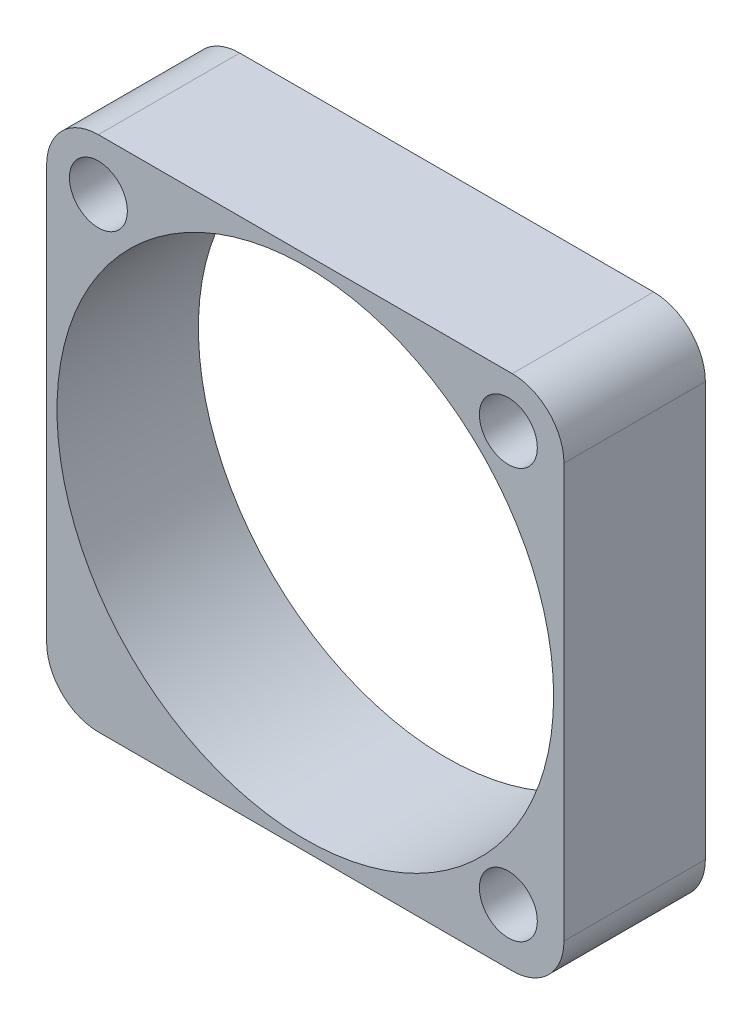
from build123d import *

# Parameters (mm, degrees)
SKETCH1_W           = 25
SKETCH1_H           = 25
BOSS_EXTRUDE1_DEPTH = 6.8325
SKETCH2_R           = 12
CUT_EXTRUDE1_DEPTH  = 37.009485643
SKETCH3_R           = 1.4
CUT_EXTRUDE2_DEPTH  = 37.009485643
FILLET1_R           = 2.5


with BuildPart() as part:
    # Sketch1 → Boss-Extrude1 (new body)
    with BuildSketch(Plane.XY):
        with Locations((12.5, 12.5)):
            Rectangle(SKETCH1_W, SKETCH1_H)
    extrude(amount=BOSS_EXTRUDE1_DEPTH)

    # Sketch2 → Cut-Extrude1 (cut, through all)
    with BuildSketch(Plane.XY.offset(6.8325)):
        with Locations((12.5, 12.5)):
            Circle(SKETCH2_R)
    extrude(amount=-CUT_EXTRUDE1_DEPTH, mode=Mode.SUBTRACT)

    # Sketch3 → Cut-Extrude2 (cut, through all)
    with BuildSketch(Plane.XY.offset(6.8325)):
        with Locations((2.5, 22.5)):
            Circle(SKETCH3_R)
        with Locations((22.312, 22.5)):
            Circle(SKETCH3_R)
        with Locations((22.312, 2.688)):
            Circle(SKETCH3_R)
    extrude(amount=-CUT_EXTRUDE2_DEPTH, mode=Mode.SUBTRACT)

    # Fillet1
    fillet1_edges = [part.edges().sort_by_distance(p)[0] for p in [
        (0, 25, 3.41625),
        (25, 25, 3.41625),
        (25, 0, 3.41625),
        (0, 0, 3.41625),
    ]]
    fillet(fillet1_edges, radius=FILLET1_R)


solid = part.part
